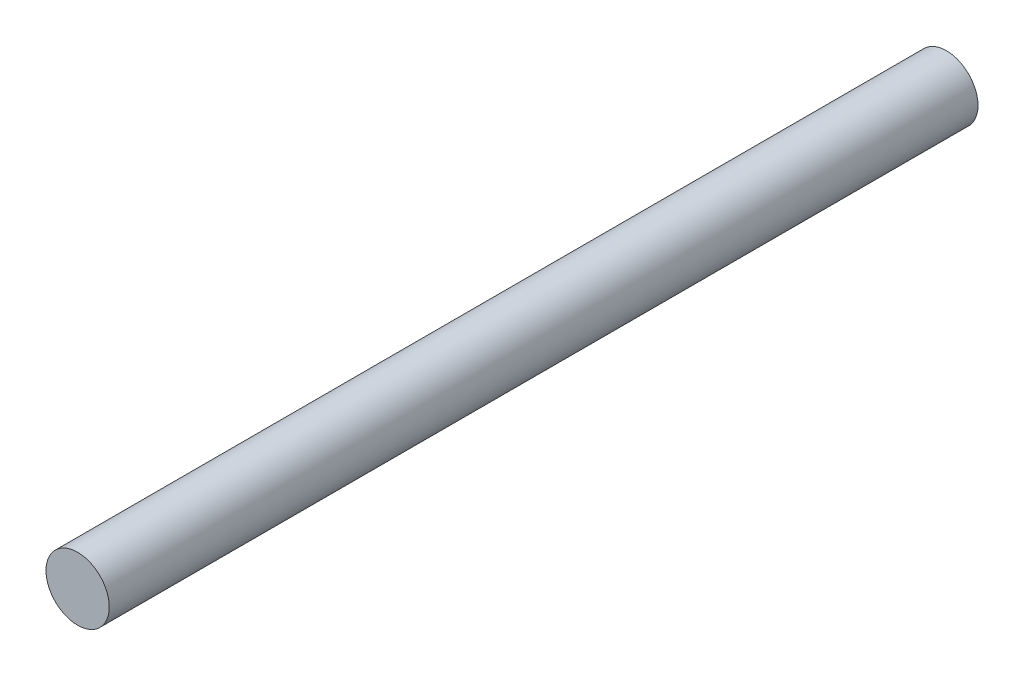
ISO-10303-21;
HEADER;
FILE_DESCRIPTION(('STEP AP214'),'2;1');
FILE_NAME('part.step','',(''),(''),'','','');
FILE_SCHEMA(('AUTOMOTIVE_DESIGN { 1 0 10303 214 1 1 1 1 }'));
ENDSEC;
DATA;
#1=APPLICATION_CONTEXT('core data for automotive mechanical design processes');
#2=APPLICATION_PROTOCOL_DEFINITION('international standard','automotive_design',2000,#1);
#3=PRODUCT_CONTEXT('',#1,'mechanical');
#4=PRODUCT('Part','Part','',(#3));
#5=PRODUCT_RELATED_PRODUCT_CATEGORY('part','',(#4));
#6=PRODUCT_DEFINITION_FORMATION('','',#4);
#7=PRODUCT_DEFINITION_CONTEXT('part definition',#1,'design');
#8=PRODUCT_DEFINITION('design','',#6,#7);
#9=PRODUCT_DEFINITION_SHAPE('','',#8);
#10=(LENGTH_UNIT() NAMED_UNIT(*) SI_UNIT(.MILLI.,.METRE.));
#11=(NAMED_UNIT(*) PLANE_ANGLE_UNIT() SI_UNIT($,.RADIAN.));
#12=(NAMED_UNIT(*) SI_UNIT($,.STERADIAN.) SOLID_ANGLE_UNIT());
#13=UNCERTAINTY_MEASURE_WITH_UNIT(LENGTH_MEASURE(1.E-05),#10,'distance_accuracy_value','');
#14=(GEOMETRIC_REPRESENTATION_CONTEXT(3) GLOBAL_UNCERTAINTY_ASSIGNED_CONTEXT((#13)) GLOBAL_UNIT_ASSIGNED_CONTEXT((#10,
#11,#12)) REPRESENTATION_CONTEXT('',''));
#15=CARTESIAN_POINT('',(0.,0.,0.));
#16=DIRECTION('',(0.,0.,1.));
#17=DIRECTION('',(1.,0.,0.));
#18=AXIS2_PLACEMENT_3D('',#15,#16,#17);
#19=CARTESIAN_POINT('',(0.,0.,30.2223153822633));
#20=DIRECTION('',(0.,0.,1.));
#21=DIRECTION('',(1.,0.,0.));
#22=AXIS2_PLACEMENT_3D('',#19,#20,#21);
#23=PLANE('',#22);
#24=CARTESIAN_POINT('',(0.,0.,30.2223153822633));
#25=DIRECTION('',(0.,0.,-1.));
#26=DIRECTION('',(-1.,0.,0.));
#27=AXIS2_PLACEMENT_3D('',#24,#25,#26);
#28=CIRCLE('',#27,2.2);
#29=CARTESIAN_POINT('',(-2.2,0.,30.2223153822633));
#30=VERTEX_POINT('',#29);
#31=EDGE_CURVE('E10',#30,#30,#28,.T.);
#32=ORIENTED_EDGE('',*,*,#31,.F.);
#33=EDGE_LOOP('',(#32));
#34=FACE_BOUND('',#33,.T.);
#35=ADVANCED_FACE('F15',(#34),#23,.T.);
#36=CARTESIAN_POINT('',(0.,0.,-30.2223153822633));
#37=DIRECTION('',(0.,0.,-1.));
#38=DIRECTION('',(-1.,0.,0.));
#39=AXIS2_PLACEMENT_3D('',#36,#37,#38);
#40=PLANE('',#39);
#41=CARTESIAN_POINT('',(0.,0.,-30.2223153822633));
#42=DIRECTION('',(0.,0.,1.));
#43=DIRECTION('',(1.,0.,0.));
#44=AXIS2_PLACEMENT_3D('',#41,#42,#43);
#45=CIRCLE('',#44,2.2);
#46=CARTESIAN_POINT('',(2.2,0.,-30.2223153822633));
#47=VERTEX_POINT('',#46);
#48=EDGE_CURVE('E22',#47,#47,#45,.T.);
#49=ORIENTED_EDGE('',*,*,#48,.F.);
#50=EDGE_LOOP('',(#49));
#51=FACE_BOUND('',#50,.T.);
#52=ADVANCED_FACE('F26',(#51),#40,.T.);
#53=CARTESIAN_POINT('',(0.,0.,-30.2223153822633));
#54=DIRECTION('',(0.,0.,1.));
#55=DIRECTION('',(1.,0.,0.));
#56=AXIS2_PLACEMENT_3D('',#53,#54,#55);
#57=CYLINDRICAL_SURFACE('',#56,2.2);
#58=ORIENTED_EDGE('',*,*,#31,.T.);
#59=EDGE_LOOP('',(#58));
#60=FACE_BOUND('',#59,.T.);
#61=ORIENTED_EDGE('',*,*,#48,.T.);
#62=EDGE_LOOP('',(#61));
#63=FACE_BOUND('',#62,.T.);
#64=ADVANCED_FACE('F17',(#60,#63),#57,.T.);
#65=CLOSED_SHELL('',(#35,#52,#64));
#66=MANIFOLD_SOLID_BREP('B1',#65);
#67=ADVANCED_BREP_SHAPE_REPRESENTATION('',(#18,#66),#14);
#68=SHAPE_DEFINITION_REPRESENTATION(#9,#67);
ENDSEC;
END-ISO-10303-21;
